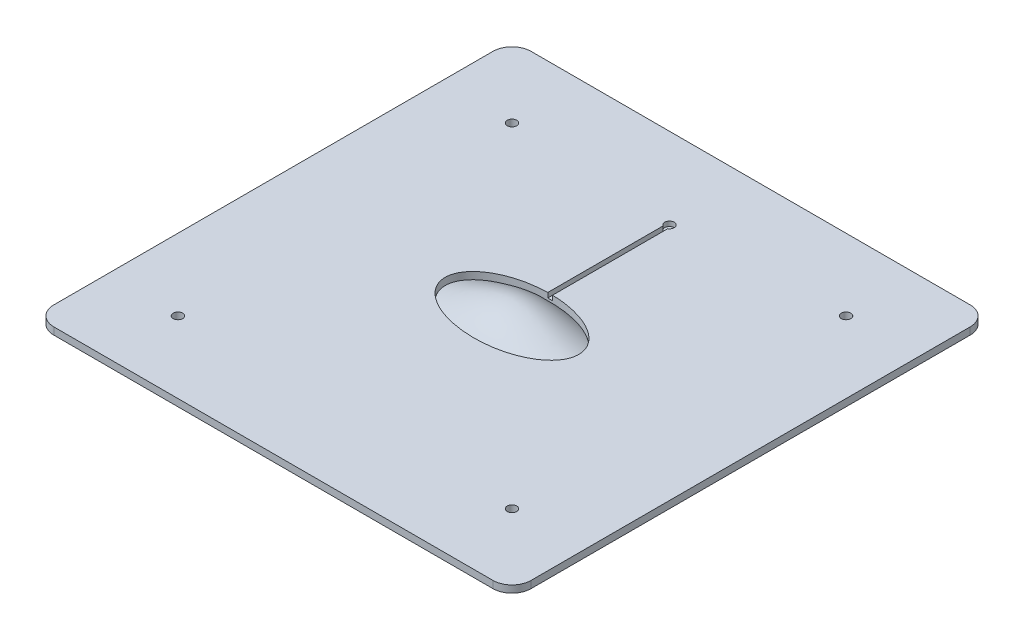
ISO-10303-21;
HEADER;
FILE_DESCRIPTION(('STEP AP214'),'2;1');
FILE_NAME('part.step','',(''),(''),'','','');
FILE_SCHEMA(('AUTOMOTIVE_DESIGN { 1 0 10303 214 1 1 1 1 }'));
ENDSEC;
DATA;
#1=APPLICATION_CONTEXT('core data for automotive mechanical design processes');
#2=APPLICATION_PROTOCOL_DEFINITION('international standard','automotive_design',2000,#1);
#3=PRODUCT_CONTEXT('',#1,'mechanical');
#4=PRODUCT('Part','Part','',(#3));
#5=PRODUCT_RELATED_PRODUCT_CATEGORY('part','',(#4));
#6=PRODUCT_DEFINITION_FORMATION('','',#4);
#7=PRODUCT_DEFINITION_CONTEXT('part definition',#1,'design');
#8=PRODUCT_DEFINITION('design','',#6,#7);
#9=PRODUCT_DEFINITION_SHAPE('','',#8);
#10=(LENGTH_UNIT() NAMED_UNIT(*) SI_UNIT(.MILLI.,.METRE.));
#11=(NAMED_UNIT(*) PLANE_ANGLE_UNIT() SI_UNIT($,.RADIAN.));
#12=(NAMED_UNIT(*) SI_UNIT($,.STERADIAN.) SOLID_ANGLE_UNIT());
#13=UNCERTAINTY_MEASURE_WITH_UNIT(LENGTH_MEASURE(1.E-05),#10,'distance_accuracy_value','');
#14=(GEOMETRIC_REPRESENTATION_CONTEXT(3) GLOBAL_UNCERTAINTY_ASSIGNED_CONTEXT((#13)) GLOBAL_UNIT_ASSIGNED_CONTEXT((#10,
#11,#12)) REPRESENTATION_CONTEXT('',''));
#15=CARTESIAN_POINT('',(0.,0.,0.));
#16=DIRECTION('',(0.,0.,1.));
#17=DIRECTION('',(1.,0.,0.));
#18=AXIS2_PLACEMENT_3D('',#15,#16,#17);
#19=CARTESIAN_POINT('',(14.,0.,-4.42782551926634E-08));
#20=CARTESIAN_POINT('',(13.999999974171,0.,-2.95188359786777E-08));
#21=CARTESIAN_POINT('',(13.999999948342,0.,-1.47594167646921E-08));
#22=CARTESIAN_POINT('',(13.999999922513,0.,0.));
#23=CARTESIAN_POINT('',(14.0000000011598,0.,0.366699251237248));
#24=CARTESIAN_POINT('',(13.9999999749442,0.,0.122232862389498));
#25=CARTESIAN_POINT('',(13.9999999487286,0.,-0.122233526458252));
#26=CARTESIAN_POINT('',(13.999999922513,0.,-0.366699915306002));
#27=CARTESIAN_POINT('',(13.9106632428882,0.,1.09987920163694));
#28=CARTESIAN_POINT('',(13.9106631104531,0.0454101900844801,0.366625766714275));
#29=CARTESIAN_POINT('',(13.9106629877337,0.0454101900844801,-0.366627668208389));
#30=CARTESIAN_POINT('',(13.9106628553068,0.,-1.09988110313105));
#31=CARTESIAN_POINT('',(13.5301975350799,0.,2.13911031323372));
#32=CARTESIAN_POINT('',(13.5301969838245,0.232727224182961,0.713035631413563));
#33=CARTESIAN_POINT('',(13.5301964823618,0.232727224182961,-0.713039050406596));
#34=CARTESIAN_POINT('',(13.5301959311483,0.,-2.13911373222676));
#35=CARTESIAN_POINT('',(12.9562300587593,0.,3.08220104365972));
#36=CARTESIAN_POINT('',(12.956228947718,0.522217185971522,1.02739885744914));
#37=CARTESIAN_POINT('',(12.9562279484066,0.522217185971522,-1.02740332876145));
#38=CARTESIAN_POINT('',(12.9562268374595,0.,-3.08220551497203));
#39=CARTESIAN_POINT('',(11.9979798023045,0.,4.19914637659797));
#40=CARTESIAN_POINT('',(11.9979778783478,1.0217292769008,1.39971369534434));
#41=CARTESIAN_POINT('',(11.9979761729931,1.0217292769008,-1.39971898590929));
#42=CARTESIAN_POINT('',(11.9979742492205,0.,-4.19915166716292));
#43=CARTESIAN_POINT('',(10.5482607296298,0.,5.33933807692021));
#44=CARTESIAN_POINT('',(10.5482578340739,1.8164076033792,1.7797775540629));
#45=CARTESIAN_POINT('',(10.5482553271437,1.8164076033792,-1.77978296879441));
#46=CARTESIAN_POINT('',(10.5482524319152,0.,-5.33934349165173));
#47=CARTESIAN_POINT('',(8.59711110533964,0.,6.36914268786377));
#48=CARTESIAN_POINT('',(8.59710738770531,2.90625216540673,2.12304601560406));
#49=CARTESIAN_POINT('',(8.59710429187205,2.90625216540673,-2.12305065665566));
#50=CARTESIAN_POINT('',(8.59710057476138,0.,-6.36914732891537));
#51=CARTESIAN_POINT('',(6.52479384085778,0.,7.12129434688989));
#52=CARTESIAN_POINT('',(6.52478980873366,3.99609672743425,2.37376367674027));
#53=CARTESIAN_POINT('',(6.52478663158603,3.99609672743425,-2.37376699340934));
#54=CARTESIAN_POINT('',(6.52478260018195,0.,-7.12129766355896));
#55=CARTESIAN_POINT('',(4.38244258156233,0.,7.63484473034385));
#56=CARTESIAN_POINT('',(4.38243888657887,4.94971071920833,2.54494764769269));
#57=CARTESIAN_POINT('',(4.38243625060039,4.94971071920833,-2.54494943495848));
#58=CARTESIAN_POINT('',(4.3824325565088,0.,-7.63484651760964));
#59=CARTESIAN_POINT('',(2.2001835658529,0.,7.93436078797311));
#60=CARTESIAN_POINT('',(2.20018098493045,5.63086357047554,2.64478678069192));
#61=CARTESIAN_POINT('',(2.20017960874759,5.63086357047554,-2.64478722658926));
#62=CARTESIAN_POINT('',(2.20017702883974,0.,-7.93436123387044));
#63=CARTESIAN_POINT('',(0.733400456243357,0.,7.99999999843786));
#64=CARTESIAN_POINT('',(0.733399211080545,5.81250433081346,2.66666666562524));
#65=CARTESIAN_POINT('',(0.733399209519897,5.81250433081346,-2.66666666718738));
#66=CARTESIAN_POINT('',(0.733397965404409,0.,-8.));
#67=CARTESIAN_POINT('',(-0.733397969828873,0.,8.00000000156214));
#68=CARTESIAN_POINT('',(-0.733399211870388,5.81250433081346,2.6666666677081));
#69=CARTESIAN_POINT('',(-0.73339921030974,5.81250433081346,-2.66666666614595));
#70=CARTESIAN_POINT('',(-0.73340045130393,0.,-8.));
#71=CARTESIAN_POINT('',(-2.20017704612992,0.,7.93436123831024));
#72=CARTESIAN_POINT('',(-2.20017961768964,5.63086357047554,2.64478722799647));
#73=CARTESIAN_POINT('',(-2.20018098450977,5.63086357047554,-2.6447867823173));
#74=CARTESIAN_POINT('',(-2.2001835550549,0.,-7.93436079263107));
#75=CARTESIAN_POINT('',(-4.38243258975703,0.,7.63484652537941));
#76=CARTESIAN_POINT('',(-4.38243626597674,4.94971071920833,2.54494943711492));
#77=CARTESIAN_POINT('',(-4.38243888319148,4.94971071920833,-2.54494765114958));
#78=CARTESIAN_POINT('',(-4.38244255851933,0.,-7.63484473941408));
#79=CARTESIAN_POINT('',(-6.52478265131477,0.,7.12129767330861));
#80=CARTESIAN_POINT('',(-6.5247866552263,3.99609672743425,2.37376699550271));
#81=CARTESIAN_POINT('',(-6.52478980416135,3.99609672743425,-2.37376368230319));
#82=CARTESIAN_POINT('',(-6.52479380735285,0.,-7.1212943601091));
#83=CARTESIAN_POINT('',(-8.59710064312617,0.,6.36914733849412));
#84=CARTESIAN_POINT('',(-8.59710432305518,2.90625216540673,2.12305065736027));
#85=CARTESIAN_POINT('',(-8.5971073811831,2.90625216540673,-2.12304602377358));
#86=CARTESIAN_POINT('',(-8.59711106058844,0.,-6.36914270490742));
#87=CARTESIAN_POINT('',(-10.5482525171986,0.,5.33934349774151));
#88=CARTESIAN_POINT('',(-10.5482553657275,1.8164076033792,1.77978296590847));
#89=CARTESIAN_POINT('',(-10.5482578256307,1.8164076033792,-1.77977756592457));
#90=CARTESIAN_POINT('',(-10.5482606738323,0.,-5.33933809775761));
#91=CARTESIAN_POINT('',(-11.9979743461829,0.,4.19915166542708));
#92=CARTESIAN_POINT('',(-11.9979762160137,1.0217292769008,1.39971897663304));
#93=CARTESIAN_POINT('',(-11.9979778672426,1.0217292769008,-1.39971371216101));
#94=CARTESIAN_POINT('',(-11.9979797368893,0.,-4.19914640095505));
#95=CARTESIAN_POINT('',(-12.9562269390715,0.,3.08220550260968));
#96=CARTESIAN_POINT('',(-12.9562279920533,0.52221718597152,1.02740331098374));
#97=CARTESIAN_POINT('',(-12.9562289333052,0.52221718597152,-1.0273988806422));
#98=CARTESIAN_POINT('',(-12.956229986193,0.,-3.08220107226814));
#99=CARTESIAN_POINT('',(-13.5301960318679,0.,2.13911370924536));
#100=CARTESIAN_POINT('',(-13.5301965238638,0.23272722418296,0.713039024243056));
#101=CARTESIAN_POINT('',(-13.5301969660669,0.23272722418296,-0.713035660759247));
#102=CARTESIAN_POINT('',(-13.5301974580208,0.,-2.13911034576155));
#103=CARTESIAN_POINT('',(-13.9106629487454,0.,1.0998810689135));
#104=CARTESIAN_POINT('',(-13.9106630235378,0.0454101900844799,0.366627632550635));
#105=CARTESIAN_POINT('',(-13.9106630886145,0.0454101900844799,-0.366625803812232));
#106=CARTESIAN_POINT('',(-13.9106631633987,0.,-1.0998792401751));
#107=CARTESIAN_POINT('',(-14.0000000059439,0.,0.366699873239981));
#108=CARTESIAN_POINT('',(-13.9999999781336,0.,0.122233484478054));
#109=CARTESIAN_POINT('',(-13.9999999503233,0.,-0.122232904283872));
#110=CARTESIAN_POINT('',(-13.999999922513,0.,-0.366699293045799));
#111=CARTESIAN_POINT('',(-14.,0.,-4.42782572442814E-08));
#112=CARTESIAN_POINT('',(-13.999999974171,0.,-2.95188387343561E-08));
#113=CARTESIAN_POINT('',(-13.999999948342,0.,-1.47594202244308E-08));
#114=CARTESIAN_POINT('',(-13.999999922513,0.,0.));
#115=B_SPLINE_SURFACE_WITH_KNOTS('',3,3,((#19,#20,#21,#22),(#23,#24,#25,#26),(#27,#28,#29,#30),
(#31,#32,#33,#34),(#35,#36,#37,#38),(#39,#40,#41,#42),(#43,#44,#45,#46),(#47,#48,#49,#50),(#51,
#52,#53,#54),(#55,#56,#57,#58),(#59,#60,#61,#62),(#63,#64,#65,#66),(#67,#68,#69,#70),(#71,#72,
#73,#74),(#75,#76,#77,#78),(#79,#80,#81,#82),(#83,#84,#85,#86),(#87,#88,#89,#90),(#91,#92,#93,
#94),(#95,#96,#97,#98),(#99,#100,#101,#102),(#103,#104,#105,#106),(#107,#108,#109,#110),(#111,
#112,#113,#114)),.UNSPECIFIED.,.F.,.F.,.F.,(4,1,1,1,1,1,1,1,1,1,2,1,1,1,1,1,1,1,1,1,4),(4,4),
(0.,0.0312499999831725,0.062499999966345,0.0937499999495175,0.12499999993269,0.187499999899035,
0.24999999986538,0.312499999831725,0.37499999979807,0.437499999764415,0.49999999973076,
0.562499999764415,0.62499999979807,0.687499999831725,0.74999999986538,0.812499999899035,
0.87499999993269,0.906249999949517,0.937499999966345,0.968749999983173,1.),(0.,1.),.UNSPECIFIED.);
#116=CARTESIAN_POINT('',(14.,0.,-4.42782551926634E-08));
#117=CARTESIAN_POINT('',(14.0000000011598,0.,0.366699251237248));
#118=CARTESIAN_POINT('',(13.9106632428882,0.,1.09987920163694));
#119=CARTESIAN_POINT('',(13.5301975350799,0.,2.13911031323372));
#120=CARTESIAN_POINT('',(12.9562300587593,0.,3.08220104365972));
#121=CARTESIAN_POINT('',(11.9979798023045,0.,4.19914637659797));
#122=CARTESIAN_POINT('',(10.5482607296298,0.,5.33933807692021));
#123=CARTESIAN_POINT('',(8.59711110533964,0.,6.36914268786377));
#124=CARTESIAN_POINT('',(6.52479384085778,0.,7.12129434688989));
#125=CARTESIAN_POINT('',(4.38244258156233,0.,7.63484473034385));
#126=CARTESIAN_POINT('',(2.2001835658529,0.,7.93436078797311));
#127=CARTESIAN_POINT('',(0.733400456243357,0.,7.99999999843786));
#128=CARTESIAN_POINT('',(-0.733397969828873,0.,8.00000000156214));
#129=CARTESIAN_POINT('',(-2.20017704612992,0.,7.93436123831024));
#130=CARTESIAN_POINT('',(-4.38243258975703,0.,7.63484652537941));
#131=CARTESIAN_POINT('',(-6.52478265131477,0.,7.12129767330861));
#132=CARTESIAN_POINT('',(-8.59710064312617,0.,6.36914733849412));
#133=CARTESIAN_POINT('',(-10.5482525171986,0.,5.33934349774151));
#134=CARTESIAN_POINT('',(-11.9979743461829,0.,4.19915166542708));
#135=CARTESIAN_POINT('',(-12.9562269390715,0.,3.08220550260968));
#136=CARTESIAN_POINT('',(-13.5301960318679,0.,2.13911370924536));
#137=CARTESIAN_POINT('',(-13.9106629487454,0.,1.0998810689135));
#138=CARTESIAN_POINT('',(-14.0000000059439,0.,0.366699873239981));
#139=CARTESIAN_POINT('',(-14.,0.,-4.42782572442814E-08));
#140=B_SPLINE_CURVE_WITH_KNOTS('',3,(#116,#117,#118,#119,#120,#121,#122,#123,#124,#125,#126,
#127,#128,#129,#130,#131,#132,#133,#134,#135,#136,#137,#138,#139),.UNSPECIFIED.,.F.,.F.,(4,1,1,
1,1,1,1,1,1,1,2,1,1,1,1,1,1,1,1,1,4),(0.,0.0312499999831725,0.062499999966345,
0.0937499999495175,0.12499999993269,0.187499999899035,0.24999999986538,0.312499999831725,
0.37499999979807,0.437499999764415,0.49999999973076,0.562499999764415,0.62499999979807,
0.687499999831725,0.74999999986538,0.812499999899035,0.87499999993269,0.906249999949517,
0.937499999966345,0.968749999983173,1.),.UNSPECIFIED.);
#141=CARTESIAN_POINT('',(14.,0.,-4.42782551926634E-08));
#142=VERTEX_POINT('',#141);
#143=CARTESIAN_POINT('',(-13.999999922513,0.,0.));
#144=VERTEX_POINT('',#143);
#145=EDGE_CURVE('E14',#142,#144,#140,.T.);
#146=CARTESIAN_POINT('',(13.999999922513,0.,0.));
#147=CARTESIAN_POINT('',(13.999999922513,0.,-0.366699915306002));
#148=CARTESIAN_POINT('',(13.9106628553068,0.,-1.09988110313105));
#149=CARTESIAN_POINT('',(13.5301959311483,0.,-2.13911373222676));
#150=CARTESIAN_POINT('',(12.9562268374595,0.,-3.08220551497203));
#151=CARTESIAN_POINT('',(11.9979742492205,0.,-4.19915166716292));
#152=CARTESIAN_POINT('',(10.5482524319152,0.,-5.33934349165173));
#153=CARTESIAN_POINT('',(8.59710057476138,0.,-6.36914732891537));
#154=CARTESIAN_POINT('',(6.52478260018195,0.,-7.12129766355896));
#155=CARTESIAN_POINT('',(4.3824325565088,0.,-7.63484651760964));
#156=CARTESIAN_POINT('',(2.20017702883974,0.,-7.93436123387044));
#157=CARTESIAN_POINT('',(0.733397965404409,0.,-8.));
#158=CARTESIAN_POINT('',(-0.73340045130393,0.,-8.));
#159=CARTESIAN_POINT('',(-2.2001835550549,0.,-7.93436079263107));
#160=CARTESIAN_POINT('',(-4.38244255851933,0.,-7.63484473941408));
#161=CARTESIAN_POINT('',(-6.52479380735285,0.,-7.1212943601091));
#162=CARTESIAN_POINT('',(-8.59711106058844,0.,-6.36914270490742));
#163=CARTESIAN_POINT('',(-10.5482606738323,0.,-5.33933809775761));
#164=CARTESIAN_POINT('',(-11.9979797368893,0.,-4.19914640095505));
#165=CARTESIAN_POINT('',(-12.956229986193,0.,-3.08220107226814));
#166=CARTESIAN_POINT('',(-13.5301974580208,0.,-2.13911034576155));
#167=CARTESIAN_POINT('',(-13.9106631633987,0.,-1.0998792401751));
#168=CARTESIAN_POINT('',(-13.999999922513,0.,-0.366699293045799));
#169=CARTESIAN_POINT('',(-13.999999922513,0.,0.));
#170=B_SPLINE_CURVE_WITH_KNOTS('',3,(#146,#147,#148,#149,#150,#151,#152,#153,#154,#155,#156,
#157,#158,#159,#160,#161,#162,#163,#164,#165,#166,#167,#168,#169),.UNSPECIFIED.,.F.,.F.,(4,1,1,
1,1,1,1,1,1,1,2,1,1,1,1,1,1,1,1,1,4),(0.,0.0312499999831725,0.062499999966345,
0.0937499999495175,0.12499999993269,0.187499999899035,0.24999999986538,0.312499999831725,
0.37499999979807,0.437499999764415,0.49999999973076,0.562499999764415,0.62499999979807,
0.687499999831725,0.74999999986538,0.812499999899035,0.87499999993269,0.906249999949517,
0.937499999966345,0.968749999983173,1.),.UNSPECIFIED.);
#171=EDGE_CURVE('E75',#144,#142,#170,.F.);
#172=ORIENTED_EDGE('',*,*,#145,.T.);
#173=ORIENTED_EDGE('',*,*,#171,.T.);
#174=EDGE_LOOP('',(#172,#173));
#175=FACE_BOUND('',#174,.T.);
#176=ADVANCED_FACE('F72',(#175),#115,.T.);
#177=OPEN_SHELL('',(#176));
#178=SHELL_BASED_SURFACE_MODEL('B2',(#177));
#179=CARTESIAN_POINT('',(-46.,1.5,46.));
#180=DIRECTION('',(0.,-1.,0.));
#181=DIRECTION('',(0.,0.,-1.));
#182=AXIS2_PLACEMENT_3D('',#179,#180,#181);
#183=CYLINDRICAL_SURFACE('',#182,4.);
#184=CARTESIAN_POINT('',(-46.,0.,46.));
#185=DIRECTION('',(0.,1.,0.));
#186=DIRECTION('',(0.,0.,-1.));
#187=AXIS2_PLACEMENT_3D('',#184,#185,#186);
#188=CIRCLE('',#187,4.);
#189=CARTESIAN_POINT('',(-50.,0.,46.));
#190=VERTEX_POINT('',#189);
#191=CARTESIAN_POINT('',(-45.9999999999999,0.,50.));
#192=VERTEX_POINT('',#191);
#193=EDGE_CURVE('E216',#190,#192,#188,.T.);
#194=ORIENTED_EDGE('',*,*,#193,.T.);
#195=DIRECTION('',(0.,-1.,0.));
#196=VECTOR('',#195,1.);
#197=CARTESIAN_POINT('',(-45.9999999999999,1.5,50.));
#198=LINE('',#197,#196);
#199=CARTESIAN_POINT('',(-45.9999999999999,1.5,50.));
#200=VERTEX_POINT('',#199);
#201=EDGE_CURVE('E70',#200,#192,#198,.T.);
#202=ORIENTED_EDGE('',*,*,#201,.F.);
#203=CARTESIAN_POINT('',(-46.,1.5,46.));
#204=DIRECTION('',(0.,1.,0.));
#205=DIRECTION('',(0.,0.,-1.));
#206=AXIS2_PLACEMENT_3D('',#203,#204,#205);
#207=CIRCLE('',#206,4.);
#208=CARTESIAN_POINT('',(-50.,1.5,46.));
#209=VERTEX_POINT('',#208);
#210=EDGE_CURVE('E230',#209,#200,#207,.T.);
#211=ORIENTED_EDGE('',*,*,#210,.F.);
#212=DIRECTION('',(0.,-1.,0.));
#213=VECTOR('',#212,1.);
#214=CARTESIAN_POINT('',(-50.,1.5,46.));
#215=LINE('',#214,#213);
#216=EDGE_CURVE('E212',#209,#190,#215,.T.);
#217=ORIENTED_EDGE('',*,*,#216,.T.);
#218=EDGE_LOOP('',(#194,#202,#211,#217));
#219=FACE_BOUND('',#218,.T.);
#220=ADVANCED_FACE('F116',(#219),#183,.T.);
#221=CARTESIAN_POINT('',(46.,1.5,50.));
#222=DIRECTION('',(0.,0.,-1.));
#223=DIRECTION('',(-1.,0.,0.));
#224=AXIS2_PLACEMENT_3D('',#221,#222,#223);
#225=PLANE('',#224);
#226=DIRECTION('',(1.,0.,0.));
#227=VECTOR('',#226,1.);
#228=CARTESIAN_POINT('',(46.,0.,50.));
#229=LINE('',#228,#227);
#230=CARTESIAN_POINT('',(46.,0.,50.));
#231=VERTEX_POINT('',#230);
#232=EDGE_CURVE('E219',#192,#231,#229,.T.);
#233=ORIENTED_EDGE('',*,*,#232,.T.);
#234=DIRECTION('',(0.,-1.,0.));
#235=VECTOR('',#234,1.);
#236=CARTESIAN_POINT('',(46.,1.5,50.));
#237=LINE('',#236,#235);
#238=CARTESIAN_POINT('',(46.,1.5,50.));
#239=VERTEX_POINT('',#238);
#240=EDGE_CURVE('E125',#239,#231,#237,.T.);
#241=ORIENTED_EDGE('',*,*,#240,.F.);
#242=DIRECTION('',(1.,0.,0.));
#243=VECTOR('',#242,1.);
#244=CARTESIAN_POINT('',(46.,1.5,50.));
#245=LINE('',#244,#243);
#246=EDGE_CURVE('E177',#200,#239,#245,.T.);
#247=ORIENTED_EDGE('',*,*,#246,.F.);
#248=ORIENTED_EDGE('',*,*,#201,.T.);
#249=EDGE_LOOP('',(#233,#241,#247,#248));
#250=FACE_BOUND('',#249,.T.);
#251=ADVANCED_FACE('F298',(#250),#225,.F.);
#252=CARTESIAN_POINT('',(46.,1.5,46.));
#253=DIRECTION('',(0.,-1.,0.));
#254=DIRECTION('',(0.,0.,-1.));
#255=AXIS2_PLACEMENT_3D('',#252,#253,#254);
#256=CYLINDRICAL_SURFACE('',#255,4.);
#257=CARTESIAN_POINT('',(46.,0.,46.));
#258=DIRECTION('',(0.,1.,0.));
#259=DIRECTION('',(0.,0.,1.));
#260=AXIS2_PLACEMENT_3D('',#257,#258,#259);
#261=CIRCLE('',#260,4.);
#262=CARTESIAN_POINT('',(50.,0.,46.));
#263=VERTEX_POINT('',#262);
#264=EDGE_CURVE('E221',#231,#263,#261,.T.);
#265=ORIENTED_EDGE('',*,*,#264,.T.);
#266=DIRECTION('',(0.,-1.,0.));
#267=VECTOR('',#266,1.);
#268=CARTESIAN_POINT('',(50.,1.5,46.));
#269=LINE('',#268,#267);
#270=CARTESIAN_POINT('',(50.,1.5,46.));
#271=VERTEX_POINT('',#270);
#272=EDGE_CURVE('E237',#271,#263,#269,.T.);
#273=ORIENTED_EDGE('',*,*,#272,.F.);
#274=CARTESIAN_POINT('',(46.,1.5,46.));
#275=DIRECTION('',(0.,1.,0.));
#276=DIRECTION('',(0.,0.,1.));
#277=AXIS2_PLACEMENT_3D('',#274,#275,#276);
#278=CIRCLE('',#277,4.);
#279=EDGE_CURVE('E246',#239,#271,#278,.T.);
#280=ORIENTED_EDGE('',*,*,#279,.F.);
#281=ORIENTED_EDGE('',*,*,#240,.T.);
#282=EDGE_LOOP('',(#265,#273,#280,#281));
#283=FACE_BOUND('',#282,.T.);
#284=ADVANCED_FACE('F244',(#283),#256,.T.);
#285=CARTESIAN_POINT('',(50.,1.5,46.));
#286=DIRECTION('',(-1.,0.,0.));
#287=DIRECTION('',(0.,0.,1.));
#288=AXIS2_PLACEMENT_3D('',#285,#286,#287);
#289=PLANE('',#288);
#290=DIRECTION('',(0.,0.,-1.));
#291=VECTOR('',#290,1.);
#292=CARTESIAN_POINT('',(50.,0.,46.));
#293=LINE('',#292,#291);
#294=CARTESIAN_POINT('',(50.,0.,-46.));
#295=VERTEX_POINT('',#294);
#296=EDGE_CURVE('E223',#263,#295,#293,.T.);
#297=ORIENTED_EDGE('',*,*,#296,.T.);
#298=DIRECTION('',(0.,-1.,0.));
#299=VECTOR('',#298,1.);
#300=CARTESIAN_POINT('',(50.,1.5,-46.));
#301=LINE('',#300,#299);
#302=CARTESIAN_POINT('',(50.,1.5,-46.));
#303=VERTEX_POINT('',#302);
#304=EDGE_CURVE('E234',#303,#295,#301,.T.);
#305=ORIENTED_EDGE('',*,*,#304,.F.);
#306=DIRECTION('',(0.,0.,-1.));
#307=VECTOR('',#306,1.);
#308=CARTESIAN_POINT('',(50.,1.5,46.));
#309=LINE('',#308,#307);
#310=EDGE_CURVE('E258',#271,#303,#309,.T.);
#311=ORIENTED_EDGE('',*,*,#310,.F.);
#312=ORIENTED_EDGE('',*,*,#272,.T.);
#313=EDGE_LOOP('',(#297,#305,#311,#312));
#314=FACE_BOUND('',#313,.T.);
#315=ADVANCED_FACE('F254',(#314),#289,.F.);
#316=CARTESIAN_POINT('',(46.,1.5,-46.));
#317=DIRECTION('',(0.,-1.,0.));
#318=DIRECTION('',(0.,0.,-1.));
#319=AXIS2_PLACEMENT_3D('',#316,#317,#318);
#320=CYLINDRICAL_SURFACE('',#319,4.);
#321=CARTESIAN_POINT('',(46.,0.,-46.));
#322=DIRECTION('',(0.,1.,0.));
#323=DIRECTION('',(0.,0.,-1.));
#324=AXIS2_PLACEMENT_3D('',#321,#322,#323);
#325=CIRCLE('',#324,4.);
#326=CARTESIAN_POINT('',(46.,0.,-50.));
#327=VERTEX_POINT('',#326);
#328=EDGE_CURVE('E225',#295,#327,#325,.T.);
#329=ORIENTED_EDGE('',*,*,#328,.T.);
#330=DIRECTION('',(0.,-1.,0.));
#331=VECTOR('',#330,1.);
#332=CARTESIAN_POINT('',(46.,1.5,-50.));
#333=LINE('',#332,#331);
#334=CARTESIAN_POINT('',(46.,1.5,-50.));
#335=VERTEX_POINT('',#334);
#336=EDGE_CURVE('E207',#335,#327,#333,.T.);
#337=ORIENTED_EDGE('',*,*,#336,.F.);
#338=CARTESIAN_POINT('',(46.,1.5,-46.));
#339=DIRECTION('',(0.,1.,0.));
#340=DIRECTION('',(0.,0.,-1.));
#341=AXIS2_PLACEMENT_3D('',#338,#339,#340);
#342=CIRCLE('',#341,4.);
#343=EDGE_CURVE('E198',#303,#335,#342,.T.);
#344=ORIENTED_EDGE('',*,*,#343,.F.);
#345=ORIENTED_EDGE('',*,*,#304,.T.);
#346=EDGE_LOOP('',(#329,#337,#344,#345));
#347=FACE_BOUND('',#346,.T.);
#348=ADVANCED_FACE('F257',(#347),#320,.T.);
#349=CARTESIAN_POINT('',(46.,1.5,-50.));
#350=DIRECTION('',(0.,0.,1.));
#351=DIRECTION('',(1.,0.,0.));
#352=AXIS2_PLACEMENT_3D('',#349,#350,#351);
#353=PLANE('',#352);
#354=DIRECTION('',(-1.,0.,0.));
#355=VECTOR('',#354,1.);
#356=CARTESIAN_POINT('',(46.,0.,-50.));
#357=LINE('',#356,#355);
#358=CARTESIAN_POINT('',(-45.9999999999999,0.,-50.));
#359=VERTEX_POINT('',#358);
#360=EDGE_CURVE('E206',#327,#359,#357,.T.);
#361=ORIENTED_EDGE('',*,*,#360,.T.);
#362=DIRECTION('',(0.,-1.,0.));
#363=VECTOR('',#362,1.);
#364=CARTESIAN_POINT('',(-45.9999999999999,1.5,-50.));
#365=LINE('',#364,#363);
#366=CARTESIAN_POINT('',(-45.9999999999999,1.5,-50.));
#367=VERTEX_POINT('',#366);
#368=EDGE_CURVE('E203',#367,#359,#365,.T.);
#369=ORIENTED_EDGE('',*,*,#368,.F.);
#370=DIRECTION('',(-1.,0.,0.));
#371=VECTOR('',#370,1.);
#372=CARTESIAN_POINT('',(46.,1.5,-50.));
#373=LINE('',#372,#371);
#374=EDGE_CURVE('E192',#335,#367,#373,.T.);
#375=ORIENTED_EDGE('',*,*,#374,.F.);
#376=ORIENTED_EDGE('',*,*,#336,.T.);
#377=EDGE_LOOP('',(#361,#369,#375,#376));
#378=FACE_BOUND('',#377,.T.);
#379=ADVANCED_FACE('F204',(#378),#353,.F.);
#380=CARTESIAN_POINT('',(-46.,1.5,-46.));
#381=DIRECTION('',(0.,-1.,0.));
#382=DIRECTION('',(0.,0.,-1.));
#383=AXIS2_PLACEMENT_3D('',#380,#381,#382);
#384=CYLINDRICAL_SURFACE('',#383,4.);
#385=CARTESIAN_POINT('',(-46.,0.,-46.));
#386=DIRECTION('',(0.,1.,0.));
#387=DIRECTION('',(0.,0.,-1.));
#388=AXIS2_PLACEMENT_3D('',#385,#386,#387);
#389=CIRCLE('',#388,4.);
#390=CARTESIAN_POINT('',(-50.,0.,-46.));
#391=VERTEX_POINT('',#390);
#392=EDGE_CURVE('E163',#359,#391,#389,.T.);
#393=ORIENTED_EDGE('',*,*,#392,.T.);
#394=DIRECTION('',(0.,-1.,0.));
#395=VECTOR('',#394,1.);
#396=CARTESIAN_POINT('',(-50.,1.5,-46.));
#397=LINE('',#396,#395);
#398=CARTESIAN_POINT('',(-50.,1.5,-46.));
#399=VERTEX_POINT('',#398);
#400=EDGE_CURVE('E208',#399,#391,#397,.T.);
#401=ORIENTED_EDGE('',*,*,#400,.F.);
#402=CARTESIAN_POINT('',(-46.,1.5,-46.));
#403=DIRECTION('',(0.,1.,0.));
#404=DIRECTION('',(0.,0.,-1.));
#405=AXIS2_PLACEMENT_3D('',#402,#403,#404);
#406=CIRCLE('',#405,4.);
#407=EDGE_CURVE('E196',#367,#399,#406,.T.);
#408=ORIENTED_EDGE('',*,*,#407,.F.);
#409=ORIENTED_EDGE('',*,*,#368,.T.);
#410=EDGE_LOOP('',(#393,#401,#408,#409));
#411=FACE_BOUND('',#410,.T.);
#412=ADVANCED_FACE('F210',(#411),#384,.T.);
#413=CARTESIAN_POINT('',(-50.,1.5,46.));
#414=DIRECTION('',(1.,0.,0.));
#415=DIRECTION('',(0.,0.,-1.));
#416=AXIS2_PLACEMENT_3D('',#413,#414,#415);
#417=PLANE('',#416);
#418=DIRECTION('',(0.,0.,1.));
#419=VECTOR('',#418,1.);
#420=CARTESIAN_POINT('',(-50.,0.,46.));
#421=LINE('',#420,#419);
#422=EDGE_CURVE('E169',#391,#190,#421,.T.);
#423=ORIENTED_EDGE('',*,*,#422,.T.);
#424=ORIENTED_EDGE('',*,*,#216,.F.);
#425=DIRECTION('',(0.,0.,1.));
#426=VECTOR('',#425,1.);
#427=CARTESIAN_POINT('',(-50.,1.5,46.));
#428=LINE('',#427,#426);
#429=EDGE_CURVE('E133',#399,#209,#428,.T.);
#430=ORIENTED_EDGE('',*,*,#429,.F.);
#431=ORIENTED_EDGE('',*,*,#400,.T.);
#432=EDGE_LOOP('',(#423,#424,#430,#431));
#433=FACE_BOUND('',#432,.T.);
#434=ADVANCED_FACE('F282',(#433),#417,.F.);
#435=CARTESIAN_POINT('',(-46.,1.5,46.));
#436=DIRECTION('',(0.,-1.,0.));
#437=DIRECTION('',(0.,0.,-1.));
#438=AXIS2_PLACEMENT_3D('',#435,#436,#437);
#439=PLANE('',#438);
#440=CARTESIAN_POINT('',(35.0000000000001,1.5,-34.9999999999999));
#441=DIRECTION('',(0.,1.,0.));
#442=DIRECTION('',(0.,0.,1.));
#443=AXIS2_PLACEMENT_3D('',#440,#441,#442);
#444=CIRCLE('',#443,0.999999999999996);
#445=CARTESIAN_POINT('',(35.0000000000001,1.5,-33.9999999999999));
#446=VERTEX_POINT('',#445);
#447=EDGE_CURVE('E553',#446,#446,#444,.T.);
#448=ORIENTED_EDGE('',*,*,#447,.F.);
#449=EDGE_LOOP('',(#448));
#450=FACE_BOUND('',#449,.T.);
#451=CARTESIAN_POINT('',(34.9999999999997,1.5,35.0000000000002));
#452=DIRECTION('',(0.,1.,0.));
#453=DIRECTION('',(0.,0.,1.));
#454=AXIS2_PLACEMENT_3D('',#451,#452,#453);
#455=CIRCLE('',#454,1.);
#456=CARTESIAN_POINT('',(34.9999999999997,1.5,36.0000000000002));
#457=VERTEX_POINT('',#456);
#458=EDGE_CURVE('E559',#457,#457,#455,.T.);
#459=ORIENTED_EDGE('',*,*,#458,.F.);
#460=EDGE_LOOP('',(#459));
#461=FACE_BOUND('',#460,.T.);
#462=CARTESIAN_POINT('',(-35.0000000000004,1.5,34.9999999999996));
#463=DIRECTION('',(0.,1.,0.));
#464=DIRECTION('',(0.,0.,1.));
#465=AXIS2_PLACEMENT_3D('',#462,#463,#464);
#466=CIRCLE('',#465,0.999999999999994);
#467=CARTESIAN_POINT('',(-35.0000000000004,1.5,35.9999999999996));
#468=VERTEX_POINT('',#467);
#469=EDGE_CURVE('E547',#468,#468,#466,.T.);
#470=ORIENTED_EDGE('',*,*,#469,.F.);
#471=EDGE_LOOP('',(#470));
#472=FACE_BOUND('',#471,.T.);
#473=CARTESIAN_POINT('',(-35.,1.5,-35.));
#474=DIRECTION('',(0.,1.,0.));
#475=DIRECTION('',(0.,0.,1.));
#476=AXIS2_PLACEMENT_3D('',#473,#474,#475);
#477=CIRCLE('',#476,0.999999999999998);
#478=CARTESIAN_POINT('',(-35.,1.5,-34.));
#479=VERTEX_POINT('',#478);
#480=EDGE_CURVE('E544',#479,#479,#477,.T.);
#481=ORIENTED_EDGE('',*,*,#480,.F.);
#482=EDGE_LOOP('',(#481));
#483=FACE_BOUND('',#482,.T.);
#484=DIRECTION('',(0.,0.,-1.));
#485=VECTOR('',#484,1.);
#486=CARTESIAN_POINT('',(-0.499999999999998,1.5,-11.2202858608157));
#487=LINE('',#486,#485);
#488=CARTESIAN_POINT('',(-0.499999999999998,1.5,-7.99489633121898));
#489=VERTEX_POINT('',#488);
#490=CARTESIAN_POINT('',(-0.5,1.5,-32.1339745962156));
#491=VERTEX_POINT('',#490);
#492=EDGE_CURVE('E270',#489,#491,#487,.T.);
#493=ORIENTED_EDGE('',*,*,#492,.T.);
#494=CARTESIAN_POINT('',(0.,1.5,-33.));
#495=DIRECTION('',(0.,1.,0.));
#496=DIRECTION('',(0.,0.,1.));
#497=AXIS2_PLACEMENT_3D('',#494,#495,#496);
#498=CIRCLE('',#497,1.);
#499=CARTESIAN_POINT('',(0.5,1.5,-32.1339745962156));
#500=VERTEX_POINT('',#499);
#501=EDGE_CURVE('E504',#500,#491,#498,.T.);
#502=ORIENTED_EDGE('',*,*,#501,.F.);
#503=DIRECTION('',(0.,0.,-1.));
#504=VECTOR('',#503,1.);
#505=CARTESIAN_POINT('',(0.500000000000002,1.5,-11.2202858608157));
#506=LINE('',#505,#504);
#507=CARTESIAN_POINT('',(0.500000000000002,1.5,-7.99489633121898));
#508=VERTEX_POINT('',#507);
#509=EDGE_CURVE('E529',#508,#500,#506,.T.);
#510=ORIENTED_EDGE('',*,*,#509,.F.);
#511=CARTESIAN_POINT('',(0.,1.5,0.));
#512=DIRECTION('',(0.,1.,0.));
#513=DIRECTION('',(-1.,0.,0.));
#514=AXIS2_PLACEMENT_3D('',#511,#512,#513);
#515=ELLIPSE('',#514,14.,8.);
#516=EDGE_CURVE('E264',#489,#508,#515,.T.);
#517=ORIENTED_EDGE('',*,*,#516,.F.);
#518=EDGE_LOOP('',(#493,#502,#510,#517));
#519=FACE_BOUND('',#518,.T.);
#520=ORIENTED_EDGE('',*,*,#210,.T.);
#521=ORIENTED_EDGE('',*,*,#246,.T.);
#522=ORIENTED_EDGE('',*,*,#279,.T.);
#523=ORIENTED_EDGE('',*,*,#310,.T.);
#524=ORIENTED_EDGE('',*,*,#343,.T.);
#525=ORIENTED_EDGE('',*,*,#374,.T.);
#526=ORIENTED_EDGE('',*,*,#407,.T.);
#527=ORIENTED_EDGE('',*,*,#429,.T.);
#528=EDGE_LOOP('',(#520,#521,#522,#523,#524,#525,#526,#527));
#529=FACE_BOUND('',#528,.T.);
#530=ADVANCED_FACE('F194',(#450,#461,#472,#483,#519,#529),#439,.F.);
#531=CARTESIAN_POINT('',(-46.,0.,46.));
#532=DIRECTION('',(0.,-1.,0.));
#533=DIRECTION('',(0.,0.,-1.));
#534=AXIS2_PLACEMENT_3D('',#531,#532,#533);
#535=PLANE('',#534);
#536=CARTESIAN_POINT('',(35.0000000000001,0.,-34.9999999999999));
#537=DIRECTION('',(0.,1.,0.));
#538=DIRECTION('',(0.,0.,1.));
#539=AXIS2_PLACEMENT_3D('',#536,#537,#538);
#540=CIRCLE('',#539,0.999999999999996);
#541=CARTESIAN_POINT('',(35.0000000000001,0.,-33.9999999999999));
#542=VERTEX_POINT('',#541);
#543=EDGE_CURVE('E550',#542,#542,#540,.T.);
#544=ORIENTED_EDGE('',*,*,#543,.T.);
#545=EDGE_LOOP('',(#544));
#546=FACE_BOUND('',#545,.T.);
#547=CARTESIAN_POINT('',(34.9999999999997,0.,35.0000000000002));
#548=DIRECTION('',(0.,1.,0.));
#549=DIRECTION('',(0.,0.,1.));
#550=AXIS2_PLACEMENT_3D('',#547,#548,#549);
#551=CIRCLE('',#550,1.);
#552=CARTESIAN_POINT('',(34.9999999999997,0.,36.0000000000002));
#553=VERTEX_POINT('',#552);
#554=EDGE_CURVE('E556',#553,#553,#551,.T.);
#555=ORIENTED_EDGE('',*,*,#554,.T.);
#556=EDGE_LOOP('',(#555));
#557=FACE_BOUND('',#556,.T.);
#558=CARTESIAN_POINT('',(-35.0000000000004,0.,34.9999999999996));
#559=DIRECTION('',(0.,1.,0.));
#560=DIRECTION('',(0.,0.,1.));
#561=AXIS2_PLACEMENT_3D('',#558,#559,#560);
#562=CIRCLE('',#561,0.999999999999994);
#563=CARTESIAN_POINT('',(-35.0000000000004,0.,35.9999999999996));
#564=VERTEX_POINT('',#563);
#565=EDGE_CURVE('E562',#564,#564,#562,.T.);
#566=ORIENTED_EDGE('',*,*,#565,.T.);
#567=EDGE_LOOP('',(#566));
#568=FACE_BOUND('',#567,.T.);
#569=CARTESIAN_POINT('',(-35.,0.,-35.));
#570=DIRECTION('',(0.,1.,0.));
#571=DIRECTION('',(0.,0.,1.));
#572=AXIS2_PLACEMENT_3D('',#569,#570,#571);
#573=CIRCLE('',#572,0.999999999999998);
#574=CARTESIAN_POINT('',(-35.,0.,-34.));
#575=VERTEX_POINT('',#574);
#576=EDGE_CURVE('E543',#575,#575,#573,.T.);
#577=ORIENTED_EDGE('',*,*,#576,.T.);
#578=EDGE_LOOP('',(#577));
#579=FACE_BOUND('',#578,.T.);
#580=CARTESIAN_POINT('',(0.,0.,0.));
#581=DIRECTION('',(0.,1.,0.));
#582=DIRECTION('',(-1.,0.,0.));
#583=AXIS2_PLACEMENT_3D('',#580,#581,#582);
#584=ELLIPSE('',#583,14.,8.);
#585=CARTESIAN_POINT('',(-14.,0.,0.));
#586=VERTEX_POINT('',#585);
#587=EDGE_CURVE('E119',#586,#586,#584,.F.);
#588=ORIENTED_EDGE('',*,*,#587,.F.);
#589=EDGE_LOOP('',(#588));
#590=FACE_BOUND('',#589,.T.);
#591=ORIENTED_EDGE('',*,*,#193,.F.);
#592=ORIENTED_EDGE('',*,*,#422,.F.);
#593=ORIENTED_EDGE('',*,*,#392,.F.);
#594=ORIENTED_EDGE('',*,*,#360,.F.);
#595=ORIENTED_EDGE('',*,*,#328,.F.);
#596=ORIENTED_EDGE('',*,*,#296,.F.);
#597=ORIENTED_EDGE('',*,*,#264,.F.);
#598=ORIENTED_EDGE('',*,*,#232,.F.);
#599=EDGE_LOOP('',(#591,#592,#593,#594,#595,#596,#597,#598));
#600=FACE_BOUND('',#599,.T.);
#601=ADVANCED_FACE('F250',(#546,#557,#568,#579,#590,#600),#535,.T.);
#602=CARTESIAN_POINT('',(0.,-8.5,0.));
#603=DIRECTION('',(0.,1.,0.));
#604=DIRECTION('',(-1.,0.,0.));
#605=AXIS2_PLACEMENT_3D('',#602,#603,#604);
#606=ELLIPSE('',#605,14.,8.);
#607=DIRECTION('',(0.,1.,0.));
#608=VECTOR('',#607,1.);
#609=SURFACE_OF_LINEAR_EXTRUSION('',#606,#608);
#610=ORIENTED_EDGE('',*,*,#587,.T.);
#611=EDGE_LOOP('',(#610));
#612=FACE_BOUND('',#611,.T.);
#613=CARTESIAN_POINT('',(0.,0.5,0.));
#614=DIRECTION('',(0.,1.,0.));
#615=DIRECTION('',(-1.,0.,0.));
#616=AXIS2_PLACEMENT_3D('',#613,#614,#615);
#617=ELLIPSE('',#616,14.,8.);
#618=CARTESIAN_POINT('',(-0.499999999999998,0.5,-7.99489633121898));
#619=VERTEX_POINT('',#618);
#620=CARTESIAN_POINT('',(0.500000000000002,0.5,-7.99489633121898));
#621=VERTEX_POINT('',#620);
#622=EDGE_CURVE('E540',#619,#621,#617,.F.);
#623=ORIENTED_EDGE('',*,*,#622,.F.);
#624=DIRECTION('',(0.,1.,0.));
#625=VECTOR('',#624,1.);
#626=CARTESIAN_POINT('',(-0.499999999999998,0.750000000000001,-7.99489633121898));
#627=LINE('',#626,#625);
#628=EDGE_CURVE('E532',#619,#489,#627,.T.);
#629=ORIENTED_EDGE('',*,*,#628,.T.);
#630=ORIENTED_EDGE('',*,*,#516,.T.);
#631=DIRECTION('',(0.,1.,0.));
#632=VECTOR('',#631,1.);
#633=CARTESIAN_POINT('',(0.500000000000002,0.750000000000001,-7.99489633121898));
#634=LINE('',#633,#632);
#635=EDGE_CURVE('E534',#508,#621,#634,.F.);
#636=ORIENTED_EDGE('',*,*,#635,.T.);
#637=EDGE_LOOP('',(#623,#629,#630,#636));
#638=FACE_BOUND('',#637,.T.);
#639=ADVANCED_FACE('F273',(#612,#638),#609,.F.);
#640=CARTESIAN_POINT('',(0.500000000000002,0.5,-11.2202858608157));
#641=DIRECTION('',(1.,0.,0.));
#642=DIRECTION('',(0.,0.,-1.));
#643=AXIS2_PLACEMENT_3D('',#640,#641,#642);
#644=PLANE('',#643);
#645=ORIENTED_EDGE('',*,*,#509,.T.);
#646=DIRECTION('',(0.,1.,0.));
#647=VECTOR('',#646,1.);
#648=CARTESIAN_POINT('',(0.5,0.5,-32.1339745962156));
#649=LINE('',#648,#647);
#650=CARTESIAN_POINT('',(0.500000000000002,0.5,-32.1339745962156));
#651=VERTEX_POINT('',#650);
#652=EDGE_CURVE('E512',#500,#651,#649,.F.);
#653=ORIENTED_EDGE('',*,*,#652,.T.);
#654=DIRECTION('',(0.,0.,-1.));
#655=VECTOR('',#654,1.);
#656=CARTESIAN_POINT('',(0.500000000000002,0.5,-11.2202858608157));
#657=LINE('',#656,#655);
#658=EDGE_CURVE('E528',#621,#651,#657,.T.);
#659=ORIENTED_EDGE('',*,*,#658,.F.);
#660=ORIENTED_EDGE('',*,*,#635,.F.);
#661=EDGE_LOOP('',(#645,#653,#659,#660));
#662=FACE_BOUND('',#661,.T.);
#663=ADVANCED_FACE('F277',(#662),#644,.F.);
#664=CARTESIAN_POINT('',(-0.499999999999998,0.5,-11.2202858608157));
#665=DIRECTION('',(1.,0.,0.));
#666=DIRECTION('',(0.,0.,-1.));
#667=AXIS2_PLACEMENT_3D('',#664,#665,#666);
#668=PLANE('',#667);
#669=DIRECTION('',(0.,1.,0.));
#670=VECTOR('',#669,1.);
#671=CARTESIAN_POINT('',(-0.5,0.5,-32.1339745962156));
#672=LINE('',#671,#670);
#673=CARTESIAN_POINT('',(-0.500000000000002,0.5,-32.1339745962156));
#674=VERTEX_POINT('',#673);
#675=EDGE_CURVE('E508',#491,#674,#672,.F.);
#676=ORIENTED_EDGE('',*,*,#675,.F.);
#677=ORIENTED_EDGE('',*,*,#492,.F.);
#678=ORIENTED_EDGE('',*,*,#628,.F.);
#679=DIRECTION('',(0.,0.,-1.));
#680=VECTOR('',#679,1.);
#681=CARTESIAN_POINT('',(-0.499999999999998,0.5,-11.2202858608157));
#682=LINE('',#681,#680);
#683=EDGE_CURVE('E267',#619,#674,#682,.T.);
#684=ORIENTED_EDGE('',*,*,#683,.T.);
#685=EDGE_LOOP('',(#676,#677,#678,#684));
#686=FACE_BOUND('',#685,.T.);
#687=ADVANCED_FACE('F437',(#686),#668,.T.);
#688=CARTESIAN_POINT('',(0.,0.5,0.));
#689=DIRECTION('',(0.,-1.,0.));
#690=DIRECTION('',(-1.,0.,0.));
#691=AXIS2_PLACEMENT_3D('',#688,#689,#690);
#692=PLANE('',#691);
#693=ORIENTED_EDGE('',*,*,#658,.T.);
#694=CARTESIAN_POINT('',(0.,0.5,-33.));
#695=DIRECTION('',(0.,1.,0.));
#696=DIRECTION('',(0.,0.,1.));
#697=AXIS2_PLACEMENT_3D('',#694,#695,#696);
#698=CIRCLE('',#697,1.);
#699=EDGE_CURVE('E519',#651,#674,#698,.T.);
#700=ORIENTED_EDGE('',*,*,#699,.T.);
#701=ORIENTED_EDGE('',*,*,#683,.F.);
#702=ORIENTED_EDGE('',*,*,#622,.T.);
#703=EDGE_LOOP('',(#693,#700,#701,#702));
#704=FACE_BOUND('',#703,.T.);
#705=ADVANCED_FACE('F384',(#704),#692,.F.);
#706=CARTESIAN_POINT('',(-35.,0.,-35.));
#707=DIRECTION('',(0.,1.,0.));
#708=DIRECTION('',(0.,0.,1.));
#709=AXIS2_PLACEMENT_3D('',#706,#707,#708);
#710=CYLINDRICAL_SURFACE('',#709,0.999999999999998);
#711=ORIENTED_EDGE('',*,*,#576,.F.);
#712=EDGE_LOOP('',(#711));
#713=FACE_BOUND('',#712,.T.);
#714=ORIENTED_EDGE('',*,*,#480,.T.);
#715=EDGE_LOOP('',(#714));
#716=FACE_BOUND('',#715,.T.);
#717=ADVANCED_FACE('F378',(#713,#716),#710,.F.);
#718=CARTESIAN_POINT('',(-35.0000000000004,0.,34.9999999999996));
#719=DIRECTION('',(0.,1.,0.));
#720=DIRECTION('',(0.,0.,1.));
#721=AXIS2_PLACEMENT_3D('',#718,#719,#720);
#722=CYLINDRICAL_SURFACE('',#721,0.999999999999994);
#723=ORIENTED_EDGE('',*,*,#565,.F.);
#724=EDGE_LOOP('',(#723));
#725=FACE_BOUND('',#724,.T.);
#726=ORIENTED_EDGE('',*,*,#469,.T.);
#727=EDGE_LOOP('',(#726));
#728=FACE_BOUND('',#727,.T.);
#729=ADVANCED_FACE('F383',(#725,#728),#722,.F.);
#730=CARTESIAN_POINT('',(34.9999999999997,0.,35.0000000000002));
#731=DIRECTION('',(0.,1.,0.));
#732=DIRECTION('',(0.,0.,1.));
#733=AXIS2_PLACEMENT_3D('',#730,#731,#732);
#734=CYLINDRICAL_SURFACE('',#733,1.);
#735=ORIENTED_EDGE('',*,*,#554,.F.);
#736=EDGE_LOOP('',(#735));
#737=FACE_BOUND('',#736,.T.);
#738=ORIENTED_EDGE('',*,*,#458,.T.);
#739=EDGE_LOOP('',(#738));
#740=FACE_BOUND('',#739,.T.);
#741=ADVANCED_FACE('F397',(#737,#740),#734,.F.);
#742=CARTESIAN_POINT('',(35.0000000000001,0.,-34.9999999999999));
#743=DIRECTION('',(0.,1.,0.));
#744=DIRECTION('',(0.,0.,1.));
#745=AXIS2_PLACEMENT_3D('',#742,#743,#744);
#746=CYLINDRICAL_SURFACE('',#745,0.999999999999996);
#747=ORIENTED_EDGE('',*,*,#543,.F.);
#748=EDGE_LOOP('',(#747));
#749=FACE_BOUND('',#748,.T.);
#750=ORIENTED_EDGE('',*,*,#447,.T.);
#751=EDGE_LOOP('',(#750));
#752=FACE_BOUND('',#751,.T.);
#753=ADVANCED_FACE('F408',(#749,#752),#746,.F.);
#754=CARTESIAN_POINT('',(0.,0.5,-33.));
#755=DIRECTION('',(0.,1.,0.));
#756=DIRECTION('',(0.,0.,1.));
#757=AXIS2_PLACEMENT_3D('',#754,#755,#756);
#758=CYLINDRICAL_SURFACE('',#757,1.);
#759=ORIENTED_EDGE('',*,*,#501,.T.);
#760=ORIENTED_EDGE('',*,*,#675,.T.);
#761=ORIENTED_EDGE('',*,*,#699,.F.);
#762=ORIENTED_EDGE('',*,*,#652,.F.);
#763=EDGE_LOOP('',(#759,#760,#761,#762));
#764=FACE_BOUND('',#763,.T.);
#765=ADVANCED_FACE('F419',(#764),#758,.F.);
#766=CLOSED_SHELL('',(#220,#251,#284,#315,#348,#379,#412,#434,#530,#601,#639,#663,#687,#705,
#717,#729,#741,#753,#765));
#767=MANIFOLD_SOLID_BREP('B8',#766);
#768=ADVANCED_BREP_SHAPE_REPRESENTATION('',(#18,#767),#14);
#769=MANIFOLD_SURFACE_SHAPE_REPRESENTATION('',(#18,#178),#14);
#770=SHAPE_REPRESENTATION('',(#18),#14);
#771=SHAPE_DEFINITION_REPRESENTATION(#9,#770);
#772=SHAPE_REPRESENTATION_RELATIONSHIP('','',#770,#768);
#773=SHAPE_REPRESENTATION_RELATIONSHIP('','',#770,#769);
ENDSEC;
END-ISO-10303-21;
